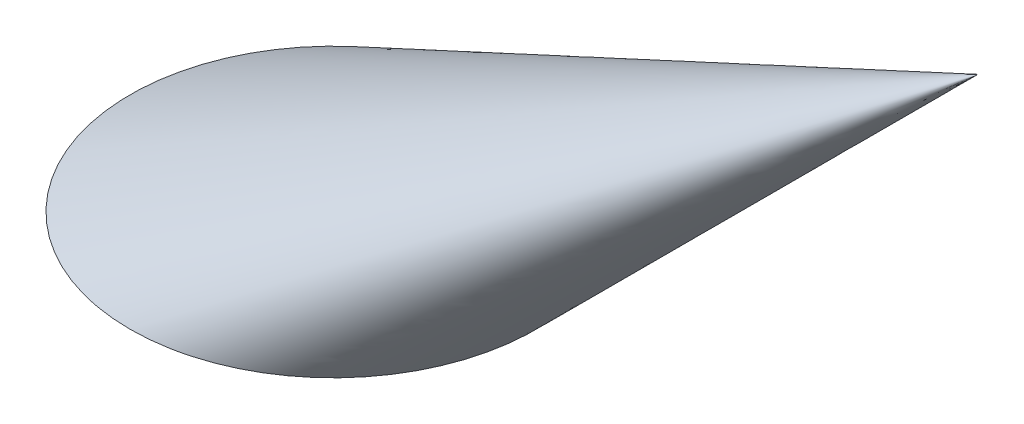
from build123d import *

# Parameters (mm, degrees)
SKETCH_1_R = 460


with BuildPart() as part:
    # Sketch 1 → Loft 1 section 0
    with BuildSketch(Plane(origin=(0, 0, 0), x_dir=(1, 0, 0), z_dir=(0, 1, 0)), mode=Mode.PRIVATE) as loft_1_s0:
        Circle(SKETCH_1_R)
    loft([loft_1_s0.sketch, Vertex(1460, 1000, 0)])


solid = part.part
